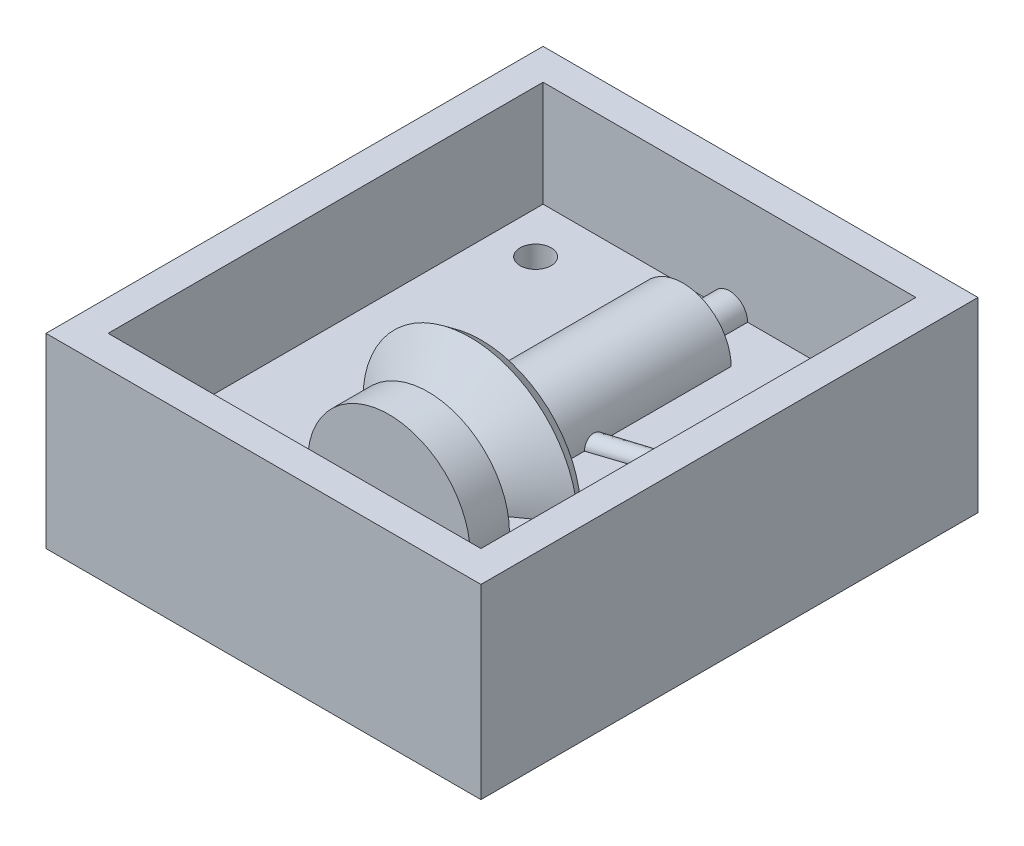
from build123d import *

# Parameters (mm, degrees)
SKETCH2_W           = 70
SKETCH2_H           = 80
BOSS_EXTRUDE1_DEPTH = 30
SKETCH3_W           = 60
SKETCH3_H           = 70
CUT_EXTRUDE1_DEPTH  = 17
SKETCH9_R           = 2.5
CUT_EXTRUDE2_DEPTH  = 8


with BuildPart() as part:
    # Sketch2 → Boss-Extrude1 (new body)
    with BuildSketch(Plane(origin=(0, 0, 0), x_dir=(1, 0, 0), z_dir=(0, 1, 0))):
        Rectangle(SKETCH2_W, SKETCH2_H)
    extrude(amount=BOSS_EXTRUDE1_DEPTH)

    # Sketch3 → Cut-Extrude1 (cut)
    with BuildSketch(Plane(origin=(0, 30, 0), x_dir=(1, 0, 0), z_dir=(0, 1, 0))):
        Rectangle(SKETCH3_W, SKETCH3_H)
    extrude(amount=-CUT_EXTRUDE1_DEPTH, mode=Mode.SUBTRACT)

    # Sketch6 → Revolve2 (revolve)
    with BuildSketch(Plane(origin=(0, 13, 0), x_dir=(1, 0, 0), z_dir=(0, 1, 0))):
        Polygon((0, 35), (0, -19.800805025), (13.0927772, -19.800805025), (13.0927772, -13.496875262), (7.758682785, -13.496875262), (17.295397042, -6.708027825), (16.057098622, -4.968513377), (7.758682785, -10.875860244), (7.758682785, 27.5106058), (2.919109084, 27.5106058), (2.919109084, 35), align=None)
    revolve(axis=Axis((0, 13, -41.783739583), (0, 0, 1)))

    # Sketch8 → Revolve3 (revolve)
    with BuildSketch(Plane(origin=(0, 13, 0), x_dir=(1, 0, 0), z_dir=(0, 1, 0))):
        Polygon((7.758682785, 5.576553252), (7.758682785, 3.902346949), (30.84004863, 11.4459731), (30, 12.688679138), align=None)
    revolve(axis=Axis((7.758682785, 13, -5.576553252), (0.9524874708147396, 0, -0.3045777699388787)))

    # Sketch9 → Cut-Extrude2 (cut)
    with BuildSketch(Plane(origin=(0, 13, 0), x_dir=(1, 0, 0), z_dir=(0, 1, 0))):
        with Locations(Location((-23.276048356, 27.074570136, 0), (0, 0, 270))):
            Circle(SKETCH9_R)
        with Locations(Location((23.276048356, 27.074570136, 0), (0, 0, 90))):
            Circle(SKETCH9_R)
        with Locations(Location((-23.276048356, -27.074570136, 0), (0, 0, 90))):
            Circle(SKETCH9_R)
        with Locations(Location((23.276048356, -27.074570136, 0), (0, 0, 270))):
            Circle(SKETCH9_R)
    extrude(amount=-CUT_EXTRUDE2_DEPTH, mode=Mode.SUBTRACT)


solid = part.part
